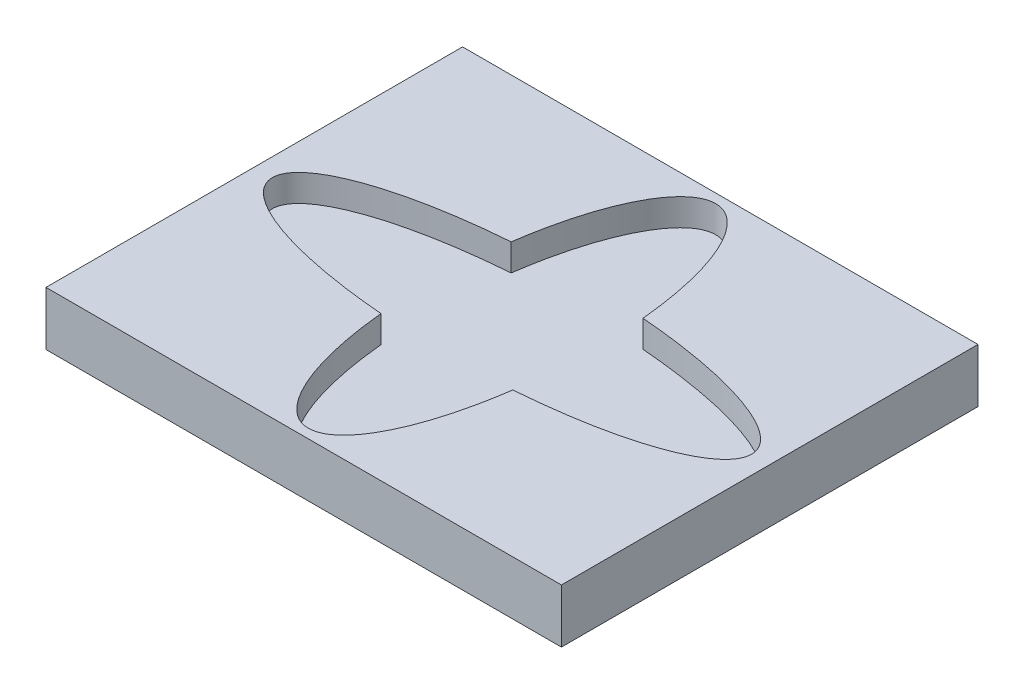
ISO-10303-21;
HEADER;
FILE_DESCRIPTION(('STEP AP214'),'2;1');
FILE_NAME('part.step','',(''),(''),'','','');
FILE_SCHEMA(('AUTOMOTIVE_DESIGN { 1 0 10303 214 1 1 1 1 }'));
ENDSEC;
DATA;
#1=APPLICATION_CONTEXT('core data for automotive mechanical design processes');
#2=APPLICATION_PROTOCOL_DEFINITION('international standard','automotive_design',2000,#1);
#3=PRODUCT_CONTEXT('',#1,'mechanical');
#4=PRODUCT('Part','Part','',(#3));
#5=PRODUCT_RELATED_PRODUCT_CATEGORY('part','',(#4));
#6=PRODUCT_DEFINITION_FORMATION('','',#4);
#7=PRODUCT_DEFINITION_CONTEXT('part definition',#1,'design');
#8=PRODUCT_DEFINITION('design','',#6,#7);
#9=PRODUCT_DEFINITION_SHAPE('','',#8);
#10=(LENGTH_UNIT() NAMED_UNIT(*) SI_UNIT(.MILLI.,.METRE.));
#11=(NAMED_UNIT(*) PLANE_ANGLE_UNIT() SI_UNIT($,.RADIAN.));
#12=(NAMED_UNIT(*) SI_UNIT($,.STERADIAN.) SOLID_ANGLE_UNIT());
#13=UNCERTAINTY_MEASURE_WITH_UNIT(LENGTH_MEASURE(1.E-05),#10,'distance_accuracy_value','');
#14=(GEOMETRIC_REPRESENTATION_CONTEXT(3) GLOBAL_UNCERTAINTY_ASSIGNED_CONTEXT((#13)) GLOBAL_UNIT_ASSIGNED_CONTEXT((#10,
#11,#12)) REPRESENTATION_CONTEXT('',''));
#15=CARTESIAN_POINT('',(0.,0.,0.));
#16=DIRECTION('',(0.,0.,1.));
#17=DIRECTION('',(1.,0.,0.));
#18=AXIS2_PLACEMENT_3D('',#15,#16,#17);
#19=CARTESIAN_POINT('',(-95.7137785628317,20.,77.3595738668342));
#20=DIRECTION('',(1.,0.,0.));
#21=DIRECTION('',(0.,0.,-1.));
#22=AXIS2_PLACEMENT_3D('',#19,#20,#21);
#23=PLANE('',#22);
#24=DIRECTION('',(0.,0.,1.));
#25=VECTOR('',#24,1.);
#26=CARTESIAN_POINT('',(-95.7137785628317,0.,77.3595738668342));
#27=LINE('',#26,#25);
#28=CARTESIAN_POINT('',(-95.7137785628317,0.,-77.3595738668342));
#29=VERTEX_POINT('',#28);
#30=CARTESIAN_POINT('',(-95.7137785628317,0.,77.3595738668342));
#31=VERTEX_POINT('',#30);
#32=EDGE_CURVE('E170',#29,#31,#27,.T.);
#33=ORIENTED_EDGE('',*,*,#32,.T.);
#34=DIRECTION('',(0.,-1.,0.));
#35=VECTOR('',#34,1.);
#36=CARTESIAN_POINT('',(-95.7137785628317,20.,77.3595738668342));
#37=LINE('',#36,#35);
#38=CARTESIAN_POINT('',(-95.7137785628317,20.,77.3595738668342));
#39=VERTEX_POINT('',#38);
#40=EDGE_CURVE('E11',#39,#31,#37,.T.);
#41=ORIENTED_EDGE('',*,*,#40,.F.);
#42=DIRECTION('',(0.,0.,1.));
#43=VECTOR('',#42,1.);
#44=CARTESIAN_POINT('',(-95.7137785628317,20.,77.3595738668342));
#45=LINE('',#44,#43);
#46=CARTESIAN_POINT('',(-95.7137785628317,20.,-77.3595738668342));
#47=VERTEX_POINT('',#46);
#48=EDGE_CURVE('E176',#47,#39,#45,.T.);
#49=ORIENTED_EDGE('',*,*,#48,.F.);
#50=DIRECTION('',(0.,-1.,0.));
#51=VECTOR('',#50,1.);
#52=CARTESIAN_POINT('',(-95.7137785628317,20.,-77.3595738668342));
#53=LINE('',#52,#51);
#54=EDGE_CURVE('E180',#47,#29,#53,.T.);
#55=ORIENTED_EDGE('',*,*,#54,.T.);
#56=EDGE_LOOP('',(#33,#41,#49,#55));
#57=FACE_BOUND('',#56,.T.);
#58=ADVANCED_FACE('F35',(#57),#23,.F.);
#59=CARTESIAN_POINT('',(95.7137785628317,20.,77.3595738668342));
#60=DIRECTION('',(0.,0.,-1.));
#61=DIRECTION('',(-1.,0.,0.));
#62=AXIS2_PLACEMENT_3D('',#59,#60,#61);
#63=PLANE('',#62);
#64=DIRECTION('',(1.,0.,0.));
#65=VECTOR('',#64,1.);
#66=CARTESIAN_POINT('',(95.7137785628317,0.,77.3595738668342));
#67=LINE('',#66,#65);
#68=CARTESIAN_POINT('',(95.7137785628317,0.,77.3595738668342));
#69=VERTEX_POINT('',#68);
#70=EDGE_CURVE('E162',#31,#69,#67,.T.);
#71=ORIENTED_EDGE('',*,*,#70,.T.);
#72=DIRECTION('',(0.,-1.,0.));
#73=VECTOR('',#72,1.);
#74=CARTESIAN_POINT('',(95.7137785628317,20.,77.3595738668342));
#75=LINE('',#74,#73);
#76=CARTESIAN_POINT('',(95.7137785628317,20.,77.3595738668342));
#77=VERTEX_POINT('',#76);
#78=EDGE_CURVE('E42',#77,#69,#75,.T.);
#79=ORIENTED_EDGE('',*,*,#78,.F.);
#80=DIRECTION('',(1.,0.,0.));
#81=VECTOR('',#80,1.);
#82=CARTESIAN_POINT('',(95.7137785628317,20.,77.3595738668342));
#83=LINE('',#82,#81);
#84=EDGE_CURVE('E86',#39,#77,#83,.T.);
#85=ORIENTED_EDGE('',*,*,#84,.F.);
#86=ORIENTED_EDGE('',*,*,#40,.T.);
#87=EDGE_LOOP('',(#71,#79,#85,#86));
#88=FACE_BOUND('',#87,.T.);
#89=ADVANCED_FACE('F155',(#88),#63,.F.);
#90=CARTESIAN_POINT('',(95.7137785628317,20.,77.3595738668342));
#91=DIRECTION('',(-1.,0.,0.));
#92=DIRECTION('',(0.,0.,1.));
#93=AXIS2_PLACEMENT_3D('',#90,#91,#92);
#94=PLANE('',#93);
#95=DIRECTION('',(0.,0.,-1.));
#96=VECTOR('',#95,1.);
#97=CARTESIAN_POINT('',(95.7137785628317,0.,77.3595738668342));
#98=LINE('',#97,#96);
#99=CARTESIAN_POINT('',(95.7137785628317,0.,-77.3595738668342));
#100=VERTEX_POINT('',#99);
#101=EDGE_CURVE('E169',#69,#100,#98,.T.);
#102=ORIENTED_EDGE('',*,*,#101,.T.);
#103=DIRECTION('',(0.,-1.,0.));
#104=VECTOR('',#103,1.);
#105=CARTESIAN_POINT('',(95.7137785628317,20.,-77.3595738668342));
#106=LINE('',#105,#104);
#107=CARTESIAN_POINT('',(95.7137785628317,20.,-77.3595738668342));
#108=VERTEX_POINT('',#107);
#109=EDGE_CURVE('E174',#108,#100,#106,.T.);
#110=ORIENTED_EDGE('',*,*,#109,.F.);
#111=DIRECTION('',(0.,0.,-1.));
#112=VECTOR('',#111,1.);
#113=CARTESIAN_POINT('',(95.7137785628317,20.,77.3595738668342));
#114=LINE('',#113,#112);
#115=EDGE_CURVE('E173',#77,#108,#114,.T.);
#116=ORIENTED_EDGE('',*,*,#115,.F.);
#117=ORIENTED_EDGE('',*,*,#78,.T.);
#118=EDGE_LOOP('',(#102,#110,#116,#117));
#119=FACE_BOUND('',#118,.T.);
#120=ADVANCED_FACE('F153',(#119),#94,.F.);
#121=CARTESIAN_POINT('',(95.7137785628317,20.,-77.3595738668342));
#122=DIRECTION('',(0.,0.,1.));
#123=DIRECTION('',(1.,0.,0.));
#124=AXIS2_PLACEMENT_3D('',#121,#122,#123);
#125=PLANE('',#124);
#126=DIRECTION('',(-1.,0.,0.));
#127=VECTOR('',#126,1.);
#128=CARTESIAN_POINT('',(95.7137785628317,0.,-77.3595738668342));
#129=LINE('',#128,#127);
#130=EDGE_CURVE('E79',#100,#29,#129,.T.);
#131=ORIENTED_EDGE('',*,*,#130,.T.);
#132=ORIENTED_EDGE('',*,*,#54,.F.);
#133=DIRECTION('',(-1.,0.,0.));
#134=VECTOR('',#133,1.);
#135=CARTESIAN_POINT('',(95.7137785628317,20.,-77.3595738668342));
#136=LINE('',#135,#134);
#137=EDGE_CURVE('E58',#108,#47,#136,.T.);
#138=ORIENTED_EDGE('',*,*,#137,.F.);
#139=ORIENTED_EDGE('',*,*,#109,.T.);
#140=EDGE_LOOP('',(#131,#132,#138,#139));
#141=FACE_BOUND('',#140,.T.);
#142=ADVANCED_FACE('F146',(#141),#125,.F.);
#143=CARTESIAN_POINT('',(-95.7137785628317,20.,-77.3595738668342));
#144=DIRECTION('',(0.,1.,0.));
#145=DIRECTION('',(0.,0.,1.));
#146=AXIS2_PLACEMENT_3D('',#143,#144,#145);
#147=PLANE('',#146);
#148=CARTESIAN_POINT('',(0.,20.,0.));
#149=DIRECTION('',(0.,1.,0.));
#150=DIRECTION('',(0.0263451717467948,0.,-0.999652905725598));
#151=AXIS2_PLACEMENT_3D('',#148,#149,#150);
#152=ELLIPSE('',#151,73.9643058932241,25.8693571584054);
#153=CARTESIAN_POINT('',(25.0716614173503,20.,-23.5785091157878));
#154=VERTEX_POINT('',#153);
#155=CARTESIAN_POINT('',(-23.968670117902,20.,-23.6658231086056));
#156=VERTEX_POINT('',#155);
#157=EDGE_CURVE('E49',#154,#156,#152,.T.);
#158=ORIENTED_EDGE('',*,*,#157,.F.);
#159=CARTESIAN_POINT('',(0.,20.,0.));
#160=DIRECTION('',(0.,1.,0.));
#161=DIRECTION('',(-1.,0.,0.));
#162=AXIS2_PLACEMENT_3D('',#159,#160,#161);
#163=ELLIPSE('',#162,88.9861736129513,24.5740406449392);
#164=CARTESIAN_POINT('',(23.968670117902,20.,23.6658231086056));
#165=VERTEX_POINT('',#164);
#166=EDGE_CURVE('E128',#165,#154,#163,.T.);
#167=ORIENTED_EDGE('',*,*,#166,.F.);
#168=CARTESIAN_POINT('',(0.,20.,0.));
#169=DIRECTION('',(0.,1.,0.));
#170=DIRECTION('',(0.0263451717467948,0.,-0.999652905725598));
#171=AXIS2_PLACEMENT_3D('',#168,#169,#170);
#172=ELLIPSE('',#171,73.9643058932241,25.8693571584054);
#173=CARTESIAN_POINT('',(-25.0716614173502,20.,23.5785091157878));
#174=VERTEX_POINT('',#173);
#175=EDGE_CURVE('E131',#174,#165,#172,.T.);
#176=ORIENTED_EDGE('',*,*,#175,.F.);
#177=CARTESIAN_POINT('',(0.,20.,0.));
#178=DIRECTION('',(0.,1.,0.));
#179=DIRECTION('',(-1.,0.,0.));
#180=AXIS2_PLACEMENT_3D('',#177,#178,#179);
#181=ELLIPSE('',#180,88.9861736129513,24.5740406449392);
#182=EDGE_CURVE('E198',#156,#174,#181,.T.);
#183=ORIENTED_EDGE('',*,*,#182,.F.);
#184=EDGE_LOOP('',(#158,#167,#176,#183));
#185=FACE_BOUND('',#184,.T.);
#186=ORIENTED_EDGE('',*,*,#48,.T.);
#187=ORIENTED_EDGE('',*,*,#84,.T.);
#188=ORIENTED_EDGE('',*,*,#115,.T.);
#189=ORIENTED_EDGE('',*,*,#137,.T.);
#190=EDGE_LOOP('',(#186,#187,#188,#189));
#191=FACE_BOUND('',#190,.T.);
#192=ADVANCED_FACE('F143',(#185,#191),#147,.T.);
#193=CARTESIAN_POINT('',(-95.7137785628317,0.,-77.3595738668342));
#194=DIRECTION('',(0.,1.,0.));
#195=DIRECTION('',(0.,0.,1.));
#196=AXIS2_PLACEMENT_3D('',#193,#194,#195);
#197=PLANE('',#196);
#198=ORIENTED_EDGE('',*,*,#32,.F.);
#199=ORIENTED_EDGE('',*,*,#130,.F.);
#200=ORIENTED_EDGE('',*,*,#101,.F.);
#201=ORIENTED_EDGE('',*,*,#70,.F.);
#202=EDGE_LOOP('',(#198,#199,#200,#201));
#203=FACE_BOUND('',#202,.T.);
#204=ADVANCED_FACE('F141',(#203),#197,.F.);
#205=CARTESIAN_POINT('',(0.,10.,0.));
#206=DIRECTION('',(0.,1.,0.));
#207=DIRECTION('',(0.0263451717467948,0.,-0.999652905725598));
#208=AXIS2_PLACEMENT_3D('',#205,#206,#207);
#209=ELLIPSE('',#208,73.9643058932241,25.8693571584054);
#210=DIRECTION('',(0.,1.,0.));
#211=VECTOR('',#210,1.);
#212=SURFACE_OF_LINEAR_EXTRUSION('',#209,#211);
#213=ORIENTED_EDGE('',*,*,#157,.T.);
#214=DIRECTION('',(0.,1.,0.));
#215=VECTOR('',#214,1.);
#216=CARTESIAN_POINT('',(-23.968670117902,10.,-23.6658231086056));
#217=LINE('',#216,#215);
#218=CARTESIAN_POINT('',(-23.968670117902,10.,-23.6658231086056));
#219=VERTEX_POINT('',#218);
#220=EDGE_CURVE('E106',#219,#156,#217,.T.);
#221=ORIENTED_EDGE('',*,*,#220,.F.);
#222=CARTESIAN_POINT('',(25.0716614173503,10.,-23.5785091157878));
#223=VERTEX_POINT('',#222);
#224=EDGE_CURVE('E110',#223,#219,#209,.T.);
#225=ORIENTED_EDGE('',*,*,#224,.F.);
#226=DIRECTION('',(0.,1.,0.));
#227=VECTOR('',#226,1.);
#228=CARTESIAN_POINT('',(25.0716614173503,10.,-23.5785091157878));
#229=LINE('',#228,#227);
#230=EDGE_CURVE('E186',#223,#154,#229,.T.);
#231=ORIENTED_EDGE('',*,*,#230,.T.);
#232=EDGE_LOOP('',(#213,#221,#225,#231));
#233=FACE_BOUND('',#232,.T.);
#234=ADVANCED_FACE('F108',(#233),#212,.F.);
#235=CARTESIAN_POINT('',(0.,10.,0.));
#236=DIRECTION('',(0.,1.,0.));
#237=DIRECTION('',(-1.,0.,0.));
#238=AXIS2_PLACEMENT_3D('',#235,#236,#237);
#239=ELLIPSE('',#238,88.9861736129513,24.5740406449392);
#240=DIRECTION('',(0.,1.,0.));
#241=VECTOR('',#240,1.);
#242=SURFACE_OF_LINEAR_EXTRUSION('',#239,#241);
#243=ORIENTED_EDGE('',*,*,#166,.T.);
#244=ORIENTED_EDGE('',*,*,#230,.F.);
#245=CARTESIAN_POINT('',(23.968670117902,10.,23.6658231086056));
#246=VERTEX_POINT('',#245);
#247=EDGE_CURVE('E116',#246,#223,#239,.T.);
#248=ORIENTED_EDGE('',*,*,#247,.F.);
#249=DIRECTION('',(0.,1.,0.));
#250=VECTOR('',#249,1.);
#251=CARTESIAN_POINT('',(23.968670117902,10.,23.6658231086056));
#252=LINE('',#251,#250);
#253=EDGE_CURVE('E187',#246,#165,#252,.T.);
#254=ORIENTED_EDGE('',*,*,#253,.T.);
#255=EDGE_LOOP('',(#243,#244,#248,#254));
#256=FACE_BOUND('',#255,.T.);
#257=ADVANCED_FACE('F140',(#256),#242,.F.);
#258=CARTESIAN_POINT('',(0.,10.,0.));
#259=DIRECTION('',(0.,1.,0.));
#260=DIRECTION('',(0.0263451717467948,0.,-0.999652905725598));
#261=AXIS2_PLACEMENT_3D('',#258,#259,#260);
#262=ELLIPSE('',#261,73.9643058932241,25.8693571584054);
#263=DIRECTION('',(0.,1.,0.));
#264=VECTOR('',#263,1.);
#265=SURFACE_OF_LINEAR_EXTRUSION('',#262,#264);
#266=ORIENTED_EDGE('',*,*,#175,.T.);
#267=ORIENTED_EDGE('',*,*,#253,.F.);
#268=CARTESIAN_POINT('',(-25.0716614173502,10.,23.5785091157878));
#269=VERTEX_POINT('',#268);
#270=EDGE_CURVE('E124',#269,#246,#262,.T.);
#271=ORIENTED_EDGE('',*,*,#270,.F.);
#272=DIRECTION('',(0.,1.,0.));
#273=VECTOR('',#272,1.);
#274=CARTESIAN_POINT('',(-25.0716614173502,10.,23.5785091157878));
#275=LINE('',#274,#273);
#276=EDGE_CURVE('E115',#269,#174,#275,.T.);
#277=ORIENTED_EDGE('',*,*,#276,.T.);
#278=EDGE_LOOP('',(#266,#267,#271,#277));
#279=FACE_BOUND('',#278,.T.);
#280=ADVANCED_FACE('F195',(#279),#265,.F.);
#281=CARTESIAN_POINT('',(0.,10.,0.));
#282=DIRECTION('',(0.,1.,0.));
#283=DIRECTION('',(-1.,0.,0.));
#284=AXIS2_PLACEMENT_3D('',#281,#282,#283);
#285=ELLIPSE('',#284,88.9861736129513,24.5740406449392);
#286=DIRECTION('',(0.,1.,0.));
#287=VECTOR('',#286,1.);
#288=SURFACE_OF_LINEAR_EXTRUSION('',#285,#287);
#289=ORIENTED_EDGE('',*,*,#182,.T.);
#290=ORIENTED_EDGE('',*,*,#276,.F.);
#291=EDGE_CURVE('E119',#219,#269,#285,.T.);
#292=ORIENTED_EDGE('',*,*,#291,.F.);
#293=ORIENTED_EDGE('',*,*,#220,.T.);
#294=EDGE_LOOP('',(#289,#290,#292,#293));
#295=FACE_BOUND('',#294,.T.);
#296=ADVANCED_FACE('F120',(#295),#288,.F.);
#297=CARTESIAN_POINT('',(0.,10.,0.));
#298=DIRECTION('',(0.,1.,0.));
#299=DIRECTION('',(0.,0.,1.));
#300=AXIS2_PLACEMENT_3D('',#297,#298,#299);
#301=PLANE('',#300);
#302=ORIENTED_EDGE('',*,*,#224,.T.);
#303=ORIENTED_EDGE('',*,*,#291,.T.);
#304=ORIENTED_EDGE('',*,*,#270,.T.);
#305=ORIENTED_EDGE('',*,*,#247,.T.);
#306=EDGE_LOOP('',(#302,#303,#304,#305));
#307=FACE_BOUND('',#306,.T.);
#308=ADVANCED_FACE('F126',(#307),#301,.T.);
#309=CLOSED_SHELL('',(#58,#89,#120,#142,#192,#204,#234,#257,#280,#296,#308));
#310=MANIFOLD_SOLID_BREP('B2',#309);
#311=ADVANCED_BREP_SHAPE_REPRESENTATION('',(#18,#310),#14);
#312=SHAPE_DEFINITION_REPRESENTATION(#9,#311);
ENDSEC;
END-ISO-10303-21;
